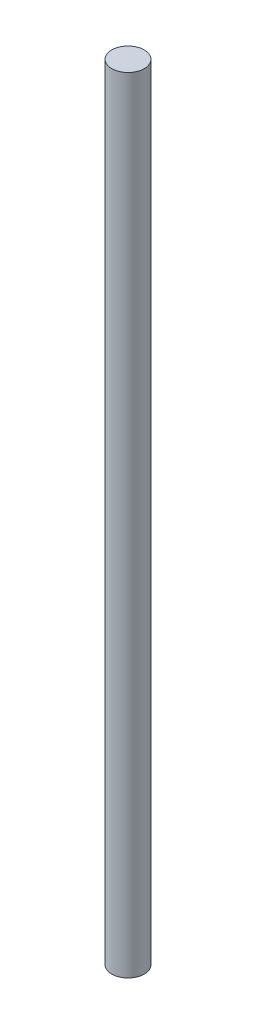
ISO-10303-21;
HEADER;
FILE_DESCRIPTION(('STEP AP214'),'2;1');
FILE_NAME('part.step','',(''),(''),'','','');
FILE_SCHEMA(('AUTOMOTIVE_DESIGN { 1 0 10303 214 1 1 1 1 }'));
ENDSEC;
DATA;
#1=APPLICATION_CONTEXT('core data for automotive mechanical design processes');
#2=APPLICATION_PROTOCOL_DEFINITION('international standard','automotive_design',2000,#1);
#3=PRODUCT_CONTEXT('',#1,'mechanical');
#4=PRODUCT('Part','Part','',(#3));
#5=PRODUCT_RELATED_PRODUCT_CATEGORY('part','',(#4));
#6=PRODUCT_DEFINITION_FORMATION('','',#4);
#7=PRODUCT_DEFINITION_CONTEXT('part definition',#1,'design');
#8=PRODUCT_DEFINITION('design','',#6,#7);
#9=PRODUCT_DEFINITION_SHAPE('','',#8);
#10=(LENGTH_UNIT() NAMED_UNIT(*) SI_UNIT(.MILLI.,.METRE.));
#11=(NAMED_UNIT(*) PLANE_ANGLE_UNIT() SI_UNIT($,.RADIAN.));
#12=(NAMED_UNIT(*) SI_UNIT($,.STERADIAN.) SOLID_ANGLE_UNIT());
#13=UNCERTAINTY_MEASURE_WITH_UNIT(LENGTH_MEASURE(1.E-05),#10,'distance_accuracy_value','');
#14=(GEOMETRIC_REPRESENTATION_CONTEXT(3) GLOBAL_UNCERTAINTY_ASSIGNED_CONTEXT((#13)) GLOBAL_UNIT_ASSIGNED_CONTEXT((#10,
#11,#12)) REPRESENTATION_CONTEXT('',''));
#15=CARTESIAN_POINT('',(0.,0.,0.));
#16=DIRECTION('',(0.,0.,1.));
#17=DIRECTION('',(1.,0.,0.));
#18=AXIS2_PLACEMENT_3D('',#15,#16,#17);
#19=CARTESIAN_POINT('',(-2.22044604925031E-13,76.1999999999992,-8.88178419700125E-13));
#20=DIRECTION('',(0.,-1.,0.));
#21=DIRECTION('',(0.,0.,-1.));
#22=AXIS2_PLACEMENT_3D('',#19,#20,#21);
#23=CYLINDRICAL_SURFACE('',#22,1.57734);
#24=CARTESIAN_POINT('',(-2.22044604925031E-13,76.1999999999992,-8.88178419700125E-13));
#25=DIRECTION('',(0.,1.,0.));
#26=DIRECTION('',(0.,0.,1.));
#27=AXIS2_PLACEMENT_3D('',#24,#25,#26);
#28=CIRCLE('',#27,1.57734);
#29=CARTESIAN_POINT('',(-2.2173814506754E-13,76.1999999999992,1.57733999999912));
#30=VERTEX_POINT('',#29);
#31=EDGE_CURVE('E10',#30,#30,#28,.T.);
#32=ORIENTED_EDGE('',*,*,#31,.F.);
#33=EDGE_LOOP('',(#32));
#34=FACE_BOUND('',#33,.T.);
#35=CARTESIAN_POINT('',(0.,0.,0.));
#36=DIRECTION('',(0.,1.,0.));
#37=DIRECTION('',(0.,0.,1.));
#38=AXIS2_PLACEMENT_3D('',#35,#36,#37);
#39=CIRCLE('',#38,1.57734);
#40=CARTESIAN_POINT('',(0.,0.,1.57734000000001));
#41=VERTEX_POINT('',#40);
#42=EDGE_CURVE('E35',#41,#41,#39,.T.);
#43=ORIENTED_EDGE('',*,*,#42,.T.);
#44=EDGE_LOOP('',(#43));
#45=FACE_BOUND('',#44,.T.);
#46=ADVANCED_FACE('F32',(#34,#45),#23,.T.);
#47=CARTESIAN_POINT('',(-2.22044604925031E-13,76.1999999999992,-8.88178419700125E-13));
#48=DIRECTION('',(0.,1.,0.));
#49=DIRECTION('',(0.,0.,1.));
#50=AXIS2_PLACEMENT_3D('',#47,#48,#49);
#51=PLANE('',#50);
#52=ORIENTED_EDGE('',*,*,#31,.T.);
#53=EDGE_LOOP('',(#52));
#54=FACE_BOUND('',#53,.T.);
#55=ADVANCED_FACE('F47',(#54),#51,.T.);
#56=CARTESIAN_POINT('',(0.,0.,0.));
#57=DIRECTION('',(0.,1.,0.));
#58=DIRECTION('',(0.,0.,1.));
#59=AXIS2_PLACEMENT_3D('',#56,#57,#58);
#60=PLANE('',#59);
#61=ORIENTED_EDGE('',*,*,#42,.F.);
#62=EDGE_LOOP('',(#61));
#63=FACE_BOUND('',#62,.T.);
#64=ADVANCED_FACE('F45',(#63),#60,.F.);
#65=CLOSED_SHELL('',(#46,#55,#64));
#66=MANIFOLD_SOLID_BREP('B2',#65);
#67=ADVANCED_BREP_SHAPE_REPRESENTATION('',(#18,#66),#14);
#68=SHAPE_DEFINITION_REPRESENTATION(#9,#67);
ENDSEC;
END-ISO-10303-21;
